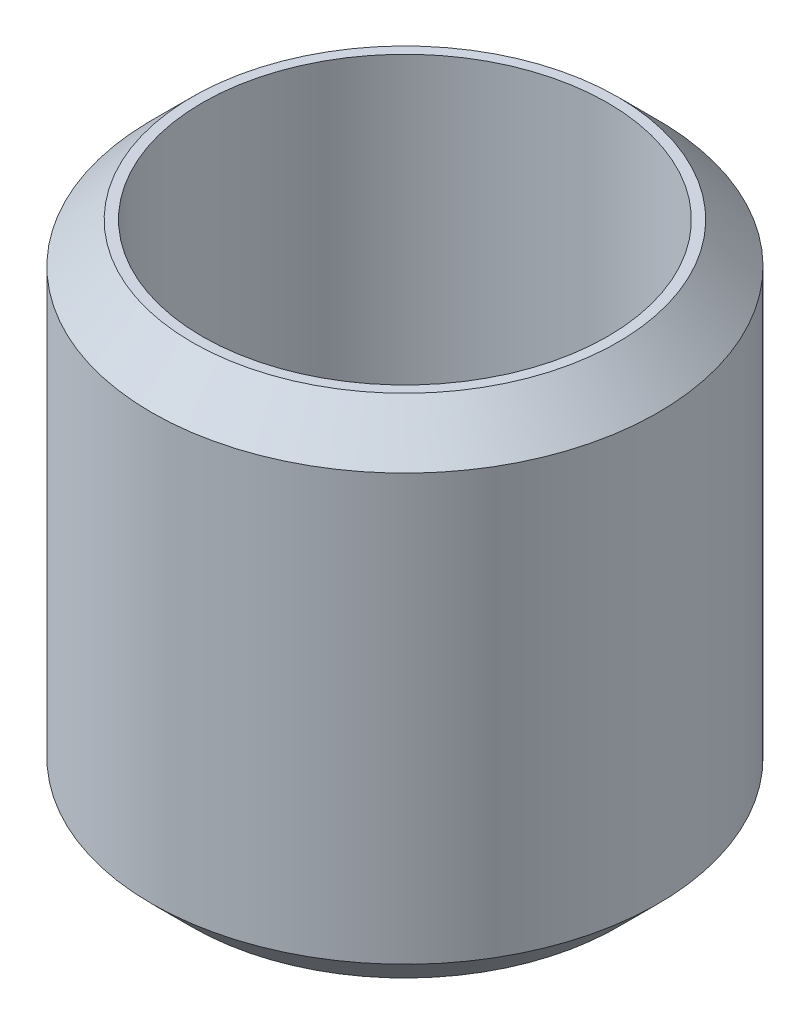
ISO-10303-21;
HEADER;
FILE_DESCRIPTION(('STEP AP214'),'2;1');
FILE_NAME('part.step','',(''),(''),'','','');
FILE_SCHEMA(('AUTOMOTIVE_DESIGN { 1 0 10303 214 1 1 1 1 }'));
ENDSEC;
DATA;
#1=APPLICATION_CONTEXT('core data for automotive mechanical design processes');
#2=APPLICATION_PROTOCOL_DEFINITION('international standard','automotive_design',2000,#1);
#3=PRODUCT_CONTEXT('',#1,'mechanical');
#4=PRODUCT('Part','Part','',(#3));
#5=PRODUCT_RELATED_PRODUCT_CATEGORY('part','',(#4));
#6=PRODUCT_DEFINITION_FORMATION('','',#4);
#7=PRODUCT_DEFINITION_CONTEXT('part definition',#1,'design');
#8=PRODUCT_DEFINITION('design','',#6,#7);
#9=PRODUCT_DEFINITION_SHAPE('','',#8);
#10=(LENGTH_UNIT() NAMED_UNIT(*) SI_UNIT(.MILLI.,.METRE.));
#11=(NAMED_UNIT(*) PLANE_ANGLE_UNIT() SI_UNIT($,.RADIAN.));
#12=(NAMED_UNIT(*) SI_UNIT($,.STERADIAN.) SOLID_ANGLE_UNIT());
#13=UNCERTAINTY_MEASURE_WITH_UNIT(LENGTH_MEASURE(1.E-05),#10,'distance_accuracy_value','');
#14=(GEOMETRIC_REPRESENTATION_CONTEXT(3) GLOBAL_UNCERTAINTY_ASSIGNED_CONTEXT((#13)) GLOBAL_UNIT_ASSIGNED_CONTEXT((#10,
#11,#12)) REPRESENTATION_CONTEXT('',''));
#15=CARTESIAN_POINT('',(0.,0.,0.));
#16=DIRECTION('',(0.,0.,1.));
#17=DIRECTION('',(1.,0.,0.));
#18=AXIS2_PLACEMENT_3D('',#15,#16,#17);
#19=CARTESIAN_POINT('',(0.,25.,0.));
#20=DIRECTION('',(0.,1.,0.));
#21=DIRECTION('',(0.,0.,1.));
#22=AXIS2_PLACEMENT_3D('',#19,#20,#21);
#23=PLANE('',#22);
#24=CARTESIAN_POINT('',(0.,25.,0.));
#25=DIRECTION('',(0.,1.,0.));
#26=DIRECTION('',(0.,0.,1.));
#27=AXIS2_PLACEMENT_3D('',#24,#25,#26);
#28=CIRCLE('',#27,10.5);
#29=CARTESIAN_POINT('',(0.,25.,10.5));
#30=VERTEX_POINT('',#29);
#31=EDGE_CURVE('E10',#30,#30,#28,.T.);
#32=ORIENTED_EDGE('',*,*,#31,.T.);
#33=EDGE_LOOP('',(#32));
#34=FACE_BOUND('',#33,.T.);
#35=CARTESIAN_POINT('',(0.,25.,0.));
#36=DIRECTION('',(0.,1.,0.));
#37=DIRECTION('',(0.,0.,1.));
#38=AXIS2_PLACEMENT_3D('',#35,#36,#37);
#39=CIRCLE('',#38,10.);
#40=CARTESIAN_POINT('',(0.,25.,10.));
#41=VERTEX_POINT('',#40);
#42=EDGE_CURVE('E50',#41,#41,#39,.T.);
#43=ORIENTED_EDGE('',*,*,#42,.F.);
#44=EDGE_LOOP('',(#43));
#45=FACE_BOUND('',#44,.T.);
#46=ADVANCED_FACE('F30',(#34,#45),#23,.T.);
#47=CARTESIAN_POINT('',(0.,0.,0.));
#48=DIRECTION('',(0.,1.,0.));
#49=DIRECTION('',(0.,0.,1.));
#50=AXIS2_PLACEMENT_3D('',#47,#48,#49);
#51=PLANE('',#50);
#52=CARTESIAN_POINT('',(0.,0.,0.));
#53=DIRECTION('',(0.,1.,0.));
#54=DIRECTION('',(0.,0.,1.));
#55=AXIS2_PLACEMENT_3D('',#52,#53,#54);
#56=CIRCLE('',#55,10.5);
#57=CARTESIAN_POINT('',(0.,0.,10.5));
#58=VERTEX_POINT('',#57);
#59=EDGE_CURVE('E37',#58,#58,#56,.F.);
#60=ORIENTED_EDGE('',*,*,#59,.T.);
#61=EDGE_LOOP('',(#60));
#62=FACE_BOUND('',#61,.T.);
#63=CARTESIAN_POINT('',(0.,0.,0.));
#64=DIRECTION('',(0.,1.,0.));
#65=DIRECTION('',(0.,0.,1.));
#66=AXIS2_PLACEMENT_3D('',#63,#64,#65);
#67=CIRCLE('',#66,10.);
#68=CARTESIAN_POINT('',(0.,0.,10.));
#69=VERTEX_POINT('',#68);
#70=EDGE_CURVE('E51',#69,#69,#67,.T.);
#71=ORIENTED_EDGE('',*,*,#70,.T.);
#72=EDGE_LOOP('',(#71));
#73=FACE_BOUND('',#72,.T.);
#74=ADVANCED_FACE('F61',(#62,#73),#51,.F.);
#75=CARTESIAN_POINT('',(0.,25.,0.));
#76=DIRECTION('',(0.,-1.,0.));
#77=DIRECTION('',(0.,0.,-1.));
#78=AXIS2_PLACEMENT_3D('',#75,#76,#77);
#79=CYLINDRICAL_SURFACE('',#78,12.5);
#80=CARTESIAN_POINT('',(0.,2.00000000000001,0.));
#81=DIRECTION('',(0.,1.,0.));
#82=DIRECTION('',(0.,0.,1.));
#83=AXIS2_PLACEMENT_3D('',#80,#81,#82);
#84=CIRCLE('',#83,12.5);
#85=CARTESIAN_POINT('',(0.,2.00000000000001,12.5));
#86=VERTEX_POINT('',#85);
#87=EDGE_CURVE('E41',#86,#86,#84,.T.);
#88=ORIENTED_EDGE('',*,*,#87,.T.);
#89=EDGE_LOOP('',(#88));
#90=FACE_BOUND('',#89,.T.);
#91=CARTESIAN_POINT('',(0.,23.,0.));
#92=DIRECTION('',(0.,1.,0.));
#93=DIRECTION('',(0.,0.,1.));
#94=AXIS2_PLACEMENT_3D('',#91,#92,#93);
#95=CIRCLE('',#94,12.5);
#96=CARTESIAN_POINT('',(0.,23.,12.5));
#97=VERTEX_POINT('',#96);
#98=EDGE_CURVE('E45',#97,#97,#95,.F.);
#99=ORIENTED_EDGE('',*,*,#98,.T.);
#100=EDGE_LOOP('',(#99));
#101=FACE_BOUND('',#100,.T.);
#102=ADVANCED_FACE('F66',(#90,#101),#79,.T.);
#103=CARTESIAN_POINT('',(0.,25.,0.));
#104=DIRECTION('',(0.,-1.,0.));
#105=DIRECTION('',(0.,0.,-1.));
#106=AXIS2_PLACEMENT_3D('',#103,#104,#105);
#107=CYLINDRICAL_SURFACE('',#106,10.);
#108=ORIENTED_EDGE('',*,*,#42,.T.);
#109=EDGE_LOOP('',(#108));
#110=FACE_BOUND('',#109,.T.);
#111=ORIENTED_EDGE('',*,*,#70,.F.);
#112=EDGE_LOOP('',(#111));
#113=FACE_BOUND('',#112,.T.);
#114=ADVANCED_FACE('F57',(#110,#113),#107,.F.);
#115=CARTESIAN_POINT('',(0.,2.00000000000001,0.));
#116=DIRECTION('',(0.,1.,0.));
#117=DIRECTION('',(0.,0.,1.));
#118=AXIS2_PLACEMENT_3D('',#115,#116,#117);
#119=CONICAL_SURFACE('',#118,12.5,0.785398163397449);
#120=ORIENTED_EDGE('',*,*,#59,.F.);
#121=EDGE_LOOP('',(#120));
#122=FACE_BOUND('',#121,.T.);
#123=ORIENTED_EDGE('',*,*,#87,.F.);
#124=EDGE_LOOP('',(#123));
#125=FACE_BOUND('',#124,.T.);
#126=ADVANCED_FACE('F72',(#122,#125),#119,.T.);
#127=CARTESIAN_POINT('',(0.,25.,0.));
#128=DIRECTION('',(0.,-1.,0.));
#129=DIRECTION('',(0.,0.,-1.));
#130=AXIS2_PLACEMENT_3D('',#127,#128,#129);
#131=CONICAL_SURFACE('',#130,10.5,0.785398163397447);
#132=ORIENTED_EDGE('',*,*,#98,.F.);
#133=EDGE_LOOP('',(#132));
#134=FACE_BOUND('',#133,.T.);
#135=ORIENTED_EDGE('',*,*,#31,.F.);
#136=EDGE_LOOP('',(#135));
#137=FACE_BOUND('',#136,.T.);
#138=ADVANCED_FACE('F32',(#134,#137),#131,.T.);
#139=CLOSED_SHELL('',(#46,#74,#102,#114,#126,#138));
#140=MANIFOLD_SOLID_BREP('B2',#139);
#141=ADVANCED_BREP_SHAPE_REPRESENTATION('',(#18,#140),#14);
#142=SHAPE_DEFINITION_REPRESENTATION(#9,#141);
ENDSEC;
END-ISO-10303-21;
